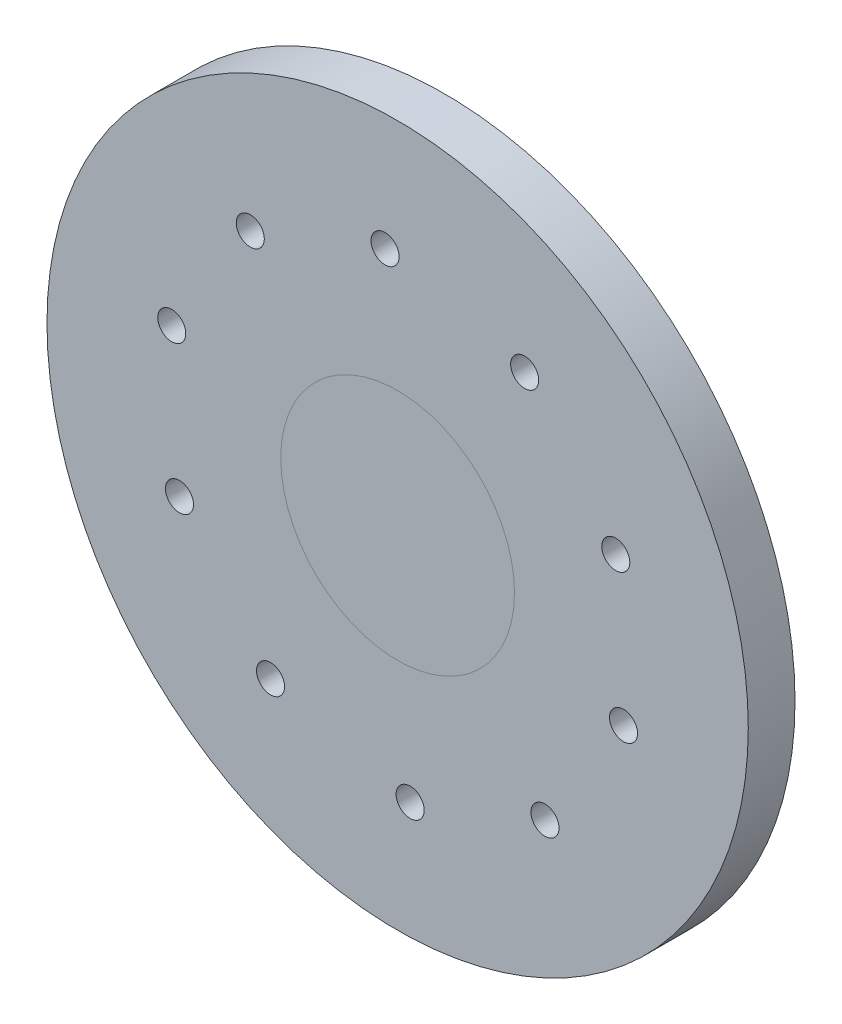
from build123d import *

# Parameters (mm, degrees)
SKETCH1_R                  = 150
BOSS_EXTRUDE1_DEPTH        = 20
F_12_0_12_DIAMETER_HOLE2_D = 12


with BuildPart() as part:
    # Sketch1 → Boss-Extrude1 (new body)
    with BuildSketch(Plane.XY):
        Circle(SKETCH1_R)
    extrude(amount=BOSS_EXTRUDE1_DEPTH)

    # 12.0 _12_ Diameter Hole2 (through all)
    with Locations(Plane(origin=(-59.628192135, -279.351148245, 0), x_dir=(1, 0, 0), z_dir=(0, 0, -1))):
        with Locations((64.993321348, -179.495175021), (122.66254126, -201.719512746), (156.254782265, -253.596496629), (152.938950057, -315.310882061), (113.981579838, -363.289871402), (54.263062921, -379.207121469), (-3.40615699, -356.982783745), (-36.998397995, -305.105799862), (-33.682565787, -243.39141443), (5.274804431, -195.412425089)):
            Hole(F_12_0_12_DIAMETER_HOLE2_D / 2)


solid = part.part
